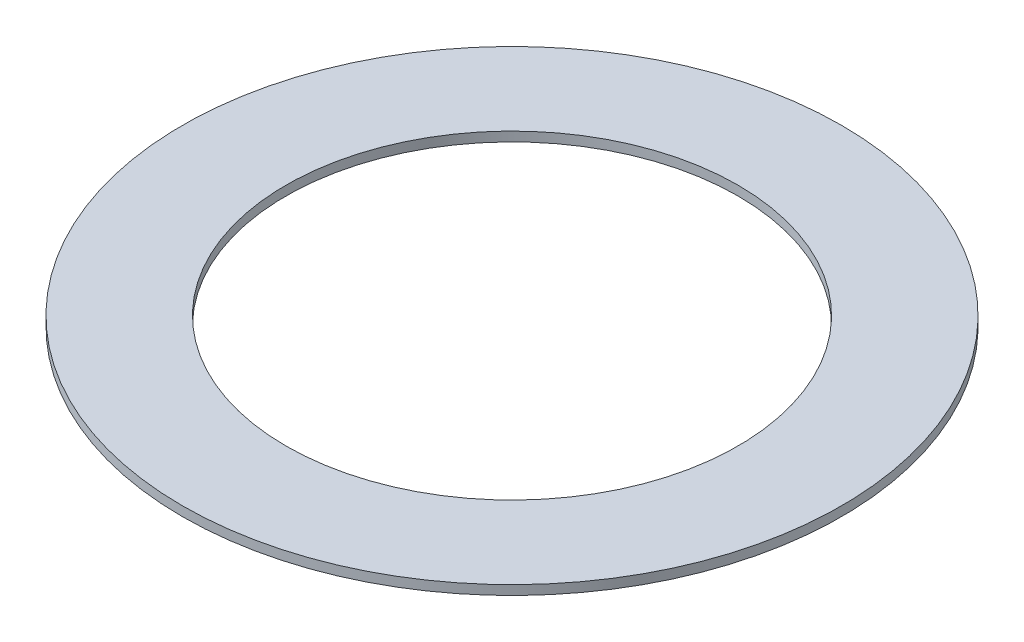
from build123d import *

# Parameters (mm, degrees)
SKETCH1_R           = 27.78125
SKETCH1_R_2         = 19.05
BOSS_EXTRUDE1_DEPTH = 0.79375


with BuildPart() as part:
    # Sketch1 → Boss-Extrude1 (new body)
    with BuildSketch(Plane(origin=(0, 0, 0), x_dir=(1, 0, 0), z_dir=(0, 1, 0))):
        with Locations(Location((0, 0, 0), (0, 0, 270))):
            Circle(SKETCH1_R)
        with Locations(Location((0, 0, 0), (0, 0, 270))):
            Circle(SKETCH1_R_2, mode=Mode.SUBTRACT)
    extrude(amount=BOSS_EXTRUDE1_DEPTH)


solid = part.part
